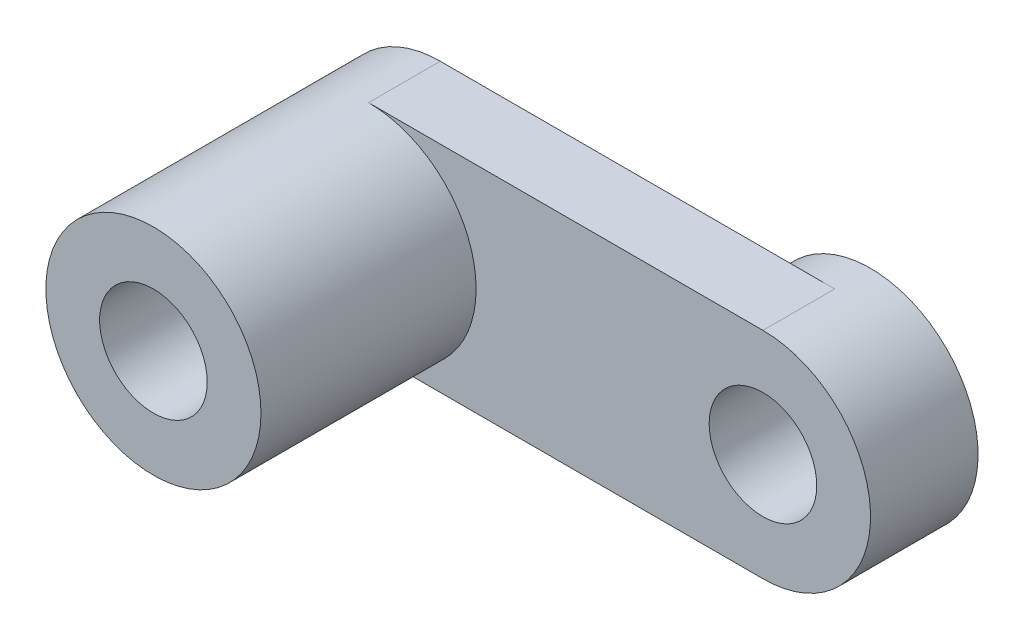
from build123d import *

# Parameters (mm, degrees)
EXTRUSION1_DEPTH        = 2
EXTRUSION2_START        = 6
ESQUISSE2_R             = 3
EXTRUSION2_DEPTH        = 6
ESQUISSE3_R             = 3
EXTRUSION3_DEPTH        = 1
ESQUISSE4_R             = 1.5
ENL_V_MAT_EXTRU_1_DEPTH = 10


with BuildPart() as part:
    # Esquisse1 → Extrusion1 (new body)
    with BuildSketch(Plane.XY):
        with BuildLine():
            Line((0, 3), (11, 3))
            ThreePointArc((11, 3), (14, 0), (11, -3))
            Line((11, -3), (0, -3))
            ThreePointArc((0, -3), (-3, 0), (0, 3))
        make_face()
    extrude(amount=-EXTRUSION1_DEPTH)

    # Esquisse2 → Extrusion2 (add)
    with BuildSketch(Plane.XY.offset(EXTRUSION2_START)):
        Circle(ESQUISSE2_R)
    extrude(amount=-EXTRUSION2_DEPTH)

    # Esquisse3 → Extrusion3 (add)
    with BuildSketch(Plane(origin=(0, 0, -2), x_dir=(-1, 0, 0), z_dir=(0, 0, -1))):
        with Locations(Location((-11, 0, 0), (0, 0, 270))):
            Circle(ESQUISSE3_R)
    extrude(amount=EXTRUSION3_DEPTH)

    # Esquisse4 → Enl_v. mat.-Extru.1 (cut, symmetric)
    with BuildSketch(Plane(origin=(0, 0, -2), x_dir=(-1, 0, 0), z_dir=(0, 0, -1))):
        with Locations((-11, 0)):
            Circle(ESQUISSE4_R)
        with Locations(Location((0, 0, 0), (0, 0, 180))):
            Circle(ESQUISSE4_R)
    extrude(amount=ENL_V_MAT_EXTRU_1_DEPTH, both=True, mode=Mode.SUBTRACT)


solid = part.part
